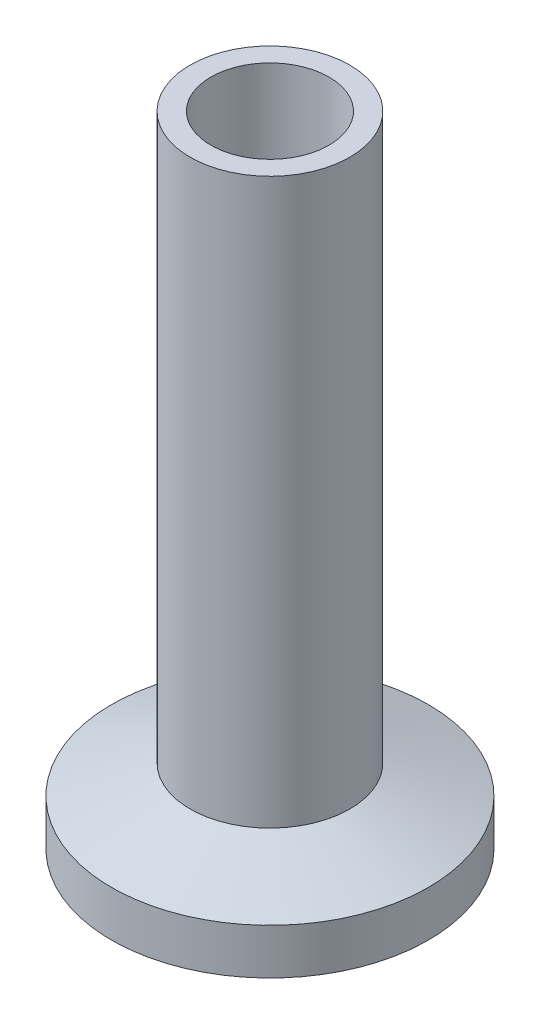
from build123d import *


with BuildPart() as part:
    # Sketch1 → Revolve1 (revolve)
    with BuildSketch(Plane.XY, mode=Mode.PRIVATE) as revolve1_sk:
        with BuildLine():
            Line((-4.699, 0.889), (-4.699, 50.8))
            Line((-4.699, 50.8), (-6.35, 50.8))
            Line((-6.35, 50.8), (-6.35, 5.906431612))
            Line((-6.35, 5.906431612), (-12.5984, 3.6322))
            Line((-12.5984, 3.6322), (-12.5984, 0))
            Line((-12.5984, 0), (-10.922, 0))
            Line((-10.922, 0), (-10.922, 1.3208))
            ThreePointArc((-10.922, 1.3208), (-10.433686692, 2.040621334), (-9.584339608, 1.852998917))
            Line((-9.584339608, 1.852998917), (-8.60238726, 0.889))
            Line((-8.60238726, 0.889), (-4.699, 0.889))
        make_face()
    revolve(revolve1_sk.sketch.rotate(Axis((0, 0, 0), (0, 1, 0)), 270), axis=Axis((0, 0, 0), (0, 1, 0)))


solid = part.part
